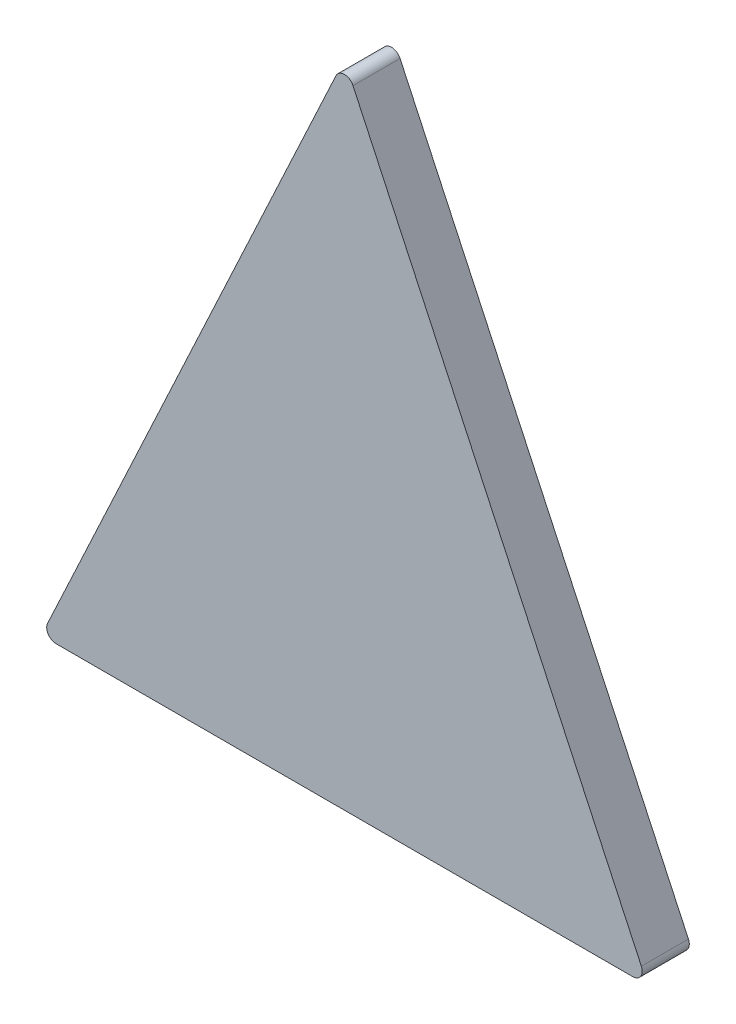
ISO-10303-21;
HEADER;
FILE_DESCRIPTION(('STEP AP214'),'2;1');
FILE_NAME('part.step','',(''),(''),'','','');
FILE_SCHEMA(('AUTOMOTIVE_DESIGN { 1 0 10303 214 1 1 1 1 }'));
ENDSEC;
DATA;
#1=APPLICATION_CONTEXT('core data for automotive mechanical design processes');
#2=APPLICATION_PROTOCOL_DEFINITION('international standard','automotive_design',2000,#1);
#3=PRODUCT_CONTEXT('',#1,'mechanical');
#4=PRODUCT('Part','Part','',(#3));
#5=PRODUCT_RELATED_PRODUCT_CATEGORY('part','',(#4));
#6=PRODUCT_DEFINITION_FORMATION('','',#4);
#7=PRODUCT_DEFINITION_CONTEXT('part definition',#1,'design');
#8=PRODUCT_DEFINITION('design','',#6,#7);
#9=PRODUCT_DEFINITION_SHAPE('','',#8);
#10=(LENGTH_UNIT() NAMED_UNIT(*) SI_UNIT(.MILLI.,.METRE.));
#11=(NAMED_UNIT(*) PLANE_ANGLE_UNIT() SI_UNIT($,.RADIAN.));
#12=(NAMED_UNIT(*) SI_UNIT($,.STERADIAN.) SOLID_ANGLE_UNIT());
#13=UNCERTAINTY_MEASURE_WITH_UNIT(LENGTH_MEASURE(1.E-05),#10,'distance_accuracy_value','');
#14=(GEOMETRIC_REPRESENTATION_CONTEXT(3) GLOBAL_UNCERTAINTY_ASSIGNED_CONTEXT((#13)) GLOBAL_UNIT_ASSIGNED_CONTEXT((#10,
#11,#12)) REPRESENTATION_CONTEXT('',''));
#15=CARTESIAN_POINT('',(0.,0.,0.));
#16=DIRECTION('',(0.,0.,1.));
#17=DIRECTION('',(1.,0.,0.));
#18=AXIS2_PLACEMENT_3D('',#15,#16,#17);
#19=CARTESIAN_POINT('',(32.2035115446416,69.0606533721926,5.));
#20=DIRECTION('',(0.906307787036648,-0.422618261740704,0.));
#21=DIRECTION('',(0.422618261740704,0.906307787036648,0.));
#22=AXIS2_PLACEMENT_3D('',#19,#20,#21);
#23=PLANE('',#22);
#24=DIRECTION('',(-0.422618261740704,-0.906307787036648,0.));
#25=VECTOR('',#24,1.);
#26=CARTESIAN_POINT('',(32.2035115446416,69.0606533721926,0.));
#27=LINE('',#26,#25);
#28=CARTESIAN_POINT('',(31.297203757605,67.1170700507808,0.));
#29=VERTEX_POINT('',#28);
#30=CARTESIAN_POINT('',(0.663377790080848,1.4226182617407,0.));
#31=VERTEX_POINT('',#30);
#32=EDGE_CURVE('E113',#29,#31,#27,.T.);
#33=ORIENTED_EDGE('',*,*,#32,.T.);
#34=DIRECTION('',(0.,0.,-1.));
#35=VECTOR('',#34,1.);
#36=CARTESIAN_POINT('',(0.663377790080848,1.4226182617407,5.));
#37=LINE('',#36,#35);
#38=CARTESIAN_POINT('',(0.663377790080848,1.4226182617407,5.));
#39=VERTEX_POINT('',#38);
#40=EDGE_CURVE('E92',#31,#39,#37,.F.);
#41=ORIENTED_EDGE('',*,*,#40,.T.);
#42=DIRECTION('',(-0.422618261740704,-0.906307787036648,0.));
#43=VECTOR('',#42,1.);
#44=CARTESIAN_POINT('',(32.2035115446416,69.0606533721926,5.));
#45=LINE('',#44,#43);
#46=CARTESIAN_POINT('',(31.297203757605,67.1170700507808,5.));
#47=VERTEX_POINT('',#46);
#48=EDGE_CURVE('E115',#47,#39,#45,.T.);
#49=ORIENTED_EDGE('',*,*,#48,.F.);
#50=DIRECTION('',(0.,0.,-1.));
#51=VECTOR('',#50,1.);
#52=CARTESIAN_POINT('',(31.297203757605,67.1170700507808,5.));
#53=LINE('',#52,#51);
#54=EDGE_CURVE('E97',#47,#29,#53,.T.);
#55=ORIENTED_EDGE('',*,*,#54,.T.);
#56=EDGE_LOOP('',(#33,#41,#49,#55));
#57=FACE_BOUND('',#56,.T.);
#58=ADVANCED_FACE('F33',(#57),#23,.F.);
#59=CARTESIAN_POINT('',(0.,0.,5.));
#60=DIRECTION('',(0.,1.,0.));
#61=DIRECTION('',(-1.,0.,0.));
#62=AXIS2_PLACEMENT_3D('',#59,#60,#61);
#63=PLANE('',#62);
#64=DIRECTION('',(1.,0.,0.));
#65=VECTOR('',#64,1.);
#66=CARTESIAN_POINT('',(0.,0.,5.));
#67=LINE('',#66,#65);
#68=CARTESIAN_POINT('',(1.56968557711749,0.,5.));
#69=VERTEX_POINT('',#68);
#70=CARTESIAN_POINT('',(62.8373375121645,0.,5.));
#71=VERTEX_POINT('',#70);
#72=EDGE_CURVE('E106',#69,#71,#67,.T.);
#73=ORIENTED_EDGE('',*,*,#72,.F.);
#74=DIRECTION('',(0.,0.,-1.));
#75=VECTOR('',#74,1.);
#76=CARTESIAN_POINT('',(1.56968557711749,0.,5.));
#77=LINE('',#76,#75);
#78=CARTESIAN_POINT('',(1.56968557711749,0.,0.));
#79=VERTEX_POINT('',#78);
#80=EDGE_CURVE('E91',#69,#79,#77,.T.);
#81=ORIENTED_EDGE('',*,*,#80,.T.);
#82=DIRECTION('',(1.,0.,0.));
#83=VECTOR('',#82,1.);
#84=CARTESIAN_POINT('',(0.,0.,0.));
#85=LINE('',#84,#83);
#86=CARTESIAN_POINT('',(62.8373375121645,0.,0.));
#87=VERTEX_POINT('',#86);
#88=EDGE_CURVE('E104',#79,#87,#85,.T.);
#89=ORIENTED_EDGE('',*,*,#88,.T.);
#90=DIRECTION('',(0.,0.,-1.));
#91=VECTOR('',#90,1.);
#92=CARTESIAN_POINT('',(62.8373375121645,0.,5.));
#93=LINE('',#92,#91);
#94=EDGE_CURVE('E108',#87,#71,#93,.F.);
#95=ORIENTED_EDGE('',*,*,#94,.T.);
#96=EDGE_LOOP('',(#73,#81,#89,#95));
#97=FACE_BOUND('',#96,.T.);
#98=ADVANCED_FACE('F103',(#97),#63,.F.);
#99=CARTESIAN_POINT('',(64.407023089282,0.,5.));
#100=DIRECTION('',(-0.906307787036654,-0.42261826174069,0.));
#101=DIRECTION('',(0.42261826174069,-0.906307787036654,0.));
#102=AXIS2_PLACEMENT_3D('',#99,#100,#101);
#103=PLANE('',#102);
#104=DIRECTION('',(-0.42261826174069,0.906307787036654,0.));
#105=VECTOR('',#104,1.);
#106=CARTESIAN_POINT('',(64.407023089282,0.,5.));
#107=LINE('',#106,#105);
#108=CARTESIAN_POINT('',(63.7436452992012,1.42261826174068,5.));
#109=VERTEX_POINT('',#108);
#110=CARTESIAN_POINT('',(33.1098193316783,67.1170700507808,5.));
#111=VERTEX_POINT('',#110);
#112=EDGE_CURVE('E120',#109,#111,#107,.T.);
#113=ORIENTED_EDGE('',*,*,#112,.F.);
#114=DIRECTION('',(0.,0.,-1.));
#115=VECTOR('',#114,1.);
#116=CARTESIAN_POINT('',(63.7436452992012,1.42261826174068,5.));
#117=LINE('',#116,#115);
#118=CARTESIAN_POINT('',(63.7436452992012,1.42261826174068,0.));
#119=VERTEX_POINT('',#118);
#120=EDGE_CURVE('E11',#109,#119,#117,.T.);
#121=ORIENTED_EDGE('',*,*,#120,.T.);
#122=DIRECTION('',(-0.42261826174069,0.906307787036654,0.));
#123=VECTOR('',#122,1.);
#124=CARTESIAN_POINT('',(64.407023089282,0.,0.));
#125=LINE('',#124,#123);
#126=CARTESIAN_POINT('',(33.1098193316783,67.1170700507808,0.));
#127=VERTEX_POINT('',#126);
#128=EDGE_CURVE('E112',#119,#127,#125,.T.);
#129=ORIENTED_EDGE('',*,*,#128,.T.);
#130=DIRECTION('',(0.,0.,-1.));
#131=VECTOR('',#130,1.);
#132=CARTESIAN_POINT('',(33.1098193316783,67.1170700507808,5.));
#133=LINE('',#132,#131);
#134=EDGE_CURVE('E41',#127,#111,#133,.F.);
#135=ORIENTED_EDGE('',*,*,#134,.T.);
#136=EDGE_LOOP('',(#113,#121,#129,#135));
#137=FACE_BOUND('',#136,.T.);
#138=ADVANCED_FACE('F141',(#137),#103,.F.);
#139=CARTESIAN_POINT('',(0.,0.,5.));
#140=DIRECTION('',(0.,0.,1.));
#141=DIRECTION('',(1.,0.,0.));
#142=AXIS2_PLACEMENT_3D('',#139,#140,#141);
#143=PLANE('',#142);
#144=ORIENTED_EDGE('',*,*,#48,.T.);
#145=CARTESIAN_POINT('',(1.56968557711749,1.,5.));
#146=DIRECTION('',(0.,0.,1.));
#147=DIRECTION('',(1.,0.,0.));
#148=AXIS2_PLACEMENT_3D('',#145,#146,#147);
#149=CIRCLE('',#148,1.);
#150=EDGE_CURVE('E130',#39,#69,#149,.T.);
#151=ORIENTED_EDGE('',*,*,#150,.T.);
#152=ORIENTED_EDGE('',*,*,#72,.T.);
#153=CARTESIAN_POINT('',(62.8373375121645,0.999999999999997,5.));
#154=DIRECTION('',(0.,0.,1.));
#155=DIRECTION('',(1.,0.,0.));
#156=AXIS2_PLACEMENT_3D('',#153,#154,#155);
#157=CIRCLE('',#156,1.);
#158=EDGE_CURVE('E54',#71,#109,#157,.T.);
#159=ORIENTED_EDGE('',*,*,#158,.T.);
#160=ORIENTED_EDGE('',*,*,#112,.T.);
#161=CARTESIAN_POINT('',(32.2035115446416,66.6944517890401,5.));
#162=DIRECTION('',(0.,0.,1.));
#163=DIRECTION('',(1.,0.,0.));
#164=AXIS2_PLACEMENT_3D('',#161,#162,#163);
#165=CIRCLE('',#164,1.);
#166=EDGE_CURVE('E127',#111,#47,#165,.T.);
#167=ORIENTED_EDGE('',*,*,#166,.T.);
#168=EDGE_LOOP('',(#144,#151,#152,#159,#160,#167));
#169=FACE_BOUND('',#168,.T.);
#170=ADVANCED_FACE('F132',(#169),#143,.T.);
#171=CARTESIAN_POINT('',(0.,0.,0.));
#172=DIRECTION('',(0.,0.,1.));
#173=DIRECTION('',(1.,0.,0.));
#174=AXIS2_PLACEMENT_3D('',#171,#172,#173);
#175=PLANE('',#174);
#176=ORIENTED_EDGE('',*,*,#88,.F.);
#177=CARTESIAN_POINT('',(1.56968557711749,1.,0.));
#178=DIRECTION('',(0.,0.,1.));
#179=DIRECTION('',(1.,0.,0.));
#180=AXIS2_PLACEMENT_3D('',#177,#178,#179);
#181=CIRCLE('',#180,1.);
#182=EDGE_CURVE('E87',#79,#31,#181,.F.);
#183=ORIENTED_EDGE('',*,*,#182,.T.);
#184=ORIENTED_EDGE('',*,*,#32,.F.);
#185=CARTESIAN_POINT('',(32.2035115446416,66.6944517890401,0.));
#186=DIRECTION('',(0.,0.,1.));
#187=DIRECTION('',(1.,0.,0.));
#188=AXIS2_PLACEMENT_3D('',#185,#186,#187);
#189=CIRCLE('',#188,1.);
#190=EDGE_CURVE('E107',#29,#127,#189,.F.);
#191=ORIENTED_EDGE('',*,*,#190,.T.);
#192=ORIENTED_EDGE('',*,*,#128,.F.);
#193=CARTESIAN_POINT('',(62.8373375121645,0.999999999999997,0.));
#194=DIRECTION('',(0.,0.,1.));
#195=DIRECTION('',(1.,0.,0.));
#196=AXIS2_PLACEMENT_3D('',#193,#194,#195);
#197=CIRCLE('',#196,1.);
#198=EDGE_CURVE('E98',#119,#87,#197,.F.);
#199=ORIENTED_EDGE('',*,*,#198,.T.);
#200=EDGE_LOOP('',(#176,#183,#184,#191,#192,#199));
#201=FACE_BOUND('',#200,.T.);
#202=ADVANCED_FACE('F110',(#201),#175,.F.);
#203=CARTESIAN_POINT('',(1.56968557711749,1.,5.));
#204=DIRECTION('',(0.,0.,-1.));
#205=DIRECTION('',(-1.,0.,0.));
#206=AXIS2_PLACEMENT_3D('',#203,#204,#205);
#207=CYLINDRICAL_SURFACE('',#206,1.);
#208=ORIENTED_EDGE('',*,*,#150,.F.);
#209=ORIENTED_EDGE('',*,*,#40,.F.);
#210=ORIENTED_EDGE('',*,*,#182,.F.);
#211=ORIENTED_EDGE('',*,*,#80,.F.);
#212=EDGE_LOOP('',(#208,#209,#210,#211));
#213=FACE_BOUND('',#212,.T.);
#214=ADVANCED_FACE('F90',(#213),#207,.T.);
#215=CARTESIAN_POINT('',(62.8373375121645,0.999999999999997,5.));
#216=DIRECTION('',(0.,0.,-1.));
#217=DIRECTION('',(-1.,0.,0.));
#218=AXIS2_PLACEMENT_3D('',#215,#216,#217);
#219=CYLINDRICAL_SURFACE('',#218,1.);
#220=ORIENTED_EDGE('',*,*,#158,.F.);
#221=ORIENTED_EDGE('',*,*,#94,.F.);
#222=ORIENTED_EDGE('',*,*,#198,.F.);
#223=ORIENTED_EDGE('',*,*,#120,.F.);
#224=EDGE_LOOP('',(#220,#221,#222,#223));
#225=FACE_BOUND('',#224,.T.);
#226=ADVANCED_FACE('F143',(#225),#219,.T.);
#227=CARTESIAN_POINT('',(32.2035115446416,66.6944517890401,5.));
#228=DIRECTION('',(0.,0.,-1.));
#229=DIRECTION('',(-1.,0.,0.));
#230=AXIS2_PLACEMENT_3D('',#227,#228,#229);
#231=CYLINDRICAL_SURFACE('',#230,1.);
#232=ORIENTED_EDGE('',*,*,#166,.F.);
#233=ORIENTED_EDGE('',*,*,#134,.F.);
#234=ORIENTED_EDGE('',*,*,#190,.F.);
#235=ORIENTED_EDGE('',*,*,#54,.F.);
#236=EDGE_LOOP('',(#232,#233,#234,#235));
#237=FACE_BOUND('',#236,.T.);
#238=ADVANCED_FACE('F35',(#237),#231,.T.);
#239=CLOSED_SHELL('',(#58,#98,#138,#170,#202,#214,#226,#238));
#240=MANIFOLD_SOLID_BREP('B2',#239);
#241=ADVANCED_BREP_SHAPE_REPRESENTATION('',(#18,#240),#14);
#242=SHAPE_DEFINITION_REPRESENTATION(#9,#241);
ENDSEC;
END-ISO-10303-21;
